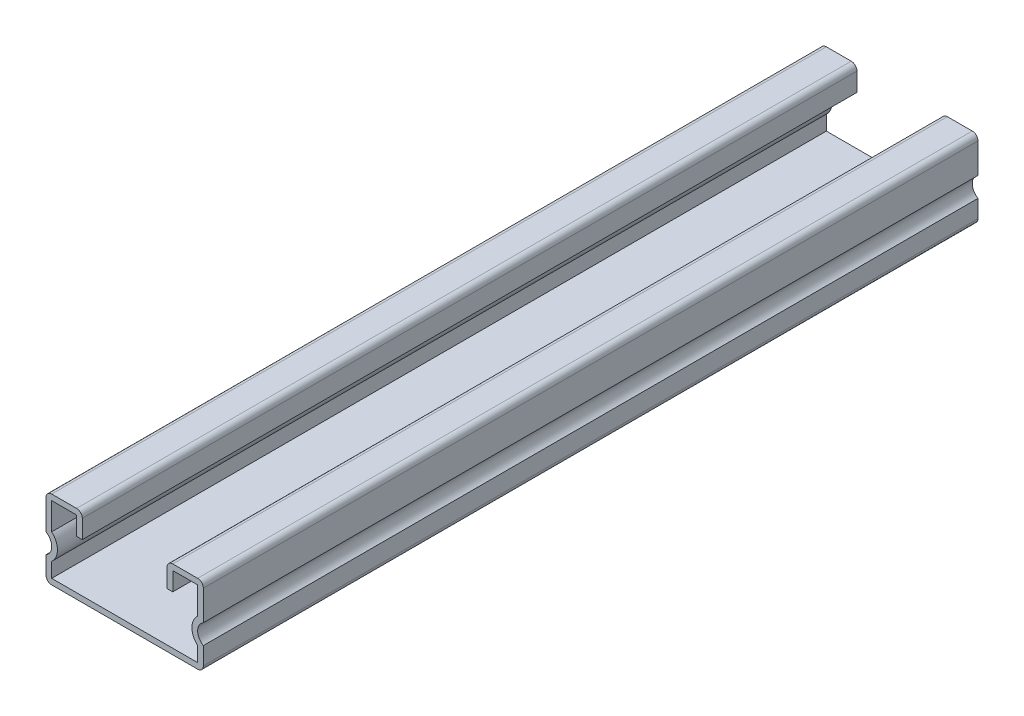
ISO-10303-21;
HEADER;
FILE_DESCRIPTION(('STEP AP214'),'2;1');
FILE_NAME('part.step','',(''),(''),'','','');
FILE_SCHEMA(('AUTOMOTIVE_DESIGN { 1 0 10303 214 1 1 1 1 }'));
ENDSEC;
DATA;
#1=APPLICATION_CONTEXT('core data for automotive mechanical design processes');
#2=APPLICATION_PROTOCOL_DEFINITION('international standard','automotive_design',2000,#1);
#3=PRODUCT_CONTEXT('',#1,'mechanical');
#4=PRODUCT('Part','Part','',(#3));
#5=PRODUCT_RELATED_PRODUCT_CATEGORY('part','',(#4));
#6=PRODUCT_DEFINITION_FORMATION('','',#4);
#7=PRODUCT_DEFINITION_CONTEXT('part definition',#1,'design');
#8=PRODUCT_DEFINITION('design','',#6,#7);
#9=PRODUCT_DEFINITION_SHAPE('','',#8);
#10=(LENGTH_UNIT() NAMED_UNIT(*) SI_UNIT(.MILLI.,.METRE.));
#11=(NAMED_UNIT(*) PLANE_ANGLE_UNIT() SI_UNIT($,.RADIAN.));
#12=(NAMED_UNIT(*) SI_UNIT($,.STERADIAN.) SOLID_ANGLE_UNIT());
#13=UNCERTAINTY_MEASURE_WITH_UNIT(LENGTH_MEASURE(1.E-05),#10,'distance_accuracy_value','');
#14=(GEOMETRIC_REPRESENTATION_CONTEXT(3) GLOBAL_UNCERTAINTY_ASSIGNED_CONTEXT((#13)) GLOBAL_UNIT_ASSIGNED_CONTEXT((#10,
#11,#12)) REPRESENTATION_CONTEXT('',''));
#15=CARTESIAN_POINT('',(0.,0.,0.));
#16=DIRECTION('',(0.,0.,1.));
#17=DIRECTION('',(1.,0.,0.));
#18=AXIS2_PLACEMENT_3D('',#15,#16,#17);
#19=CARTESIAN_POINT('',(-19.1389,10.4394,203.2));
#20=DIRECTION('',(-1.,0.,0.));
#21=DIRECTION('',(0.,0.,1.));
#22=AXIS2_PLACEMENT_3D('',#19,#20,#21);
#23=PLANE('',#22);
#24=DIRECTION('',(0.,1.,0.));
#25=VECTOR('',#24,1.);
#26=CARTESIAN_POINT('',(-19.1389,10.4394,0.));
#27=LINE('',#26,#25);
#28=CARTESIAN_POINT('',(-19.1389,3.35097147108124,0.));
#29=VERTEX_POINT('',#28);
#30=CARTESIAN_POINT('',(-19.1389,10.4394,0.));
#31=VERTEX_POINT('',#30);
#32=EDGE_CURVE('E326',#29,#31,#27,.T.);
#33=ORIENTED_EDGE('',*,*,#32,.T.);
#34=DIRECTION('',(0.,0.,-1.));
#35=VECTOR('',#34,1.);
#36=CARTESIAN_POINT('',(-19.1389,10.4394,203.2));
#37=LINE('',#36,#35);
#38=CARTESIAN_POINT('',(-19.1389,10.4394,203.2));
#39=VERTEX_POINT('',#38);
#40=EDGE_CURVE('E541',#39,#31,#37,.T.);
#41=ORIENTED_EDGE('',*,*,#40,.F.);
#42=DIRECTION('',(0.,1.,0.));
#43=VECTOR('',#42,1.);
#44=CARTESIAN_POINT('',(-19.1389,10.4394,203.2));
#45=LINE('',#44,#43);
#46=CARTESIAN_POINT('',(-19.1389,3.35097147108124,203.2));
#47=VERTEX_POINT('',#46);
#48=EDGE_CURVE('E333',#47,#39,#45,.T.);
#49=ORIENTED_EDGE('',*,*,#48,.F.);
#50=DIRECTION('',(0.,0.,-1.));
#51=VECTOR('',#50,1.);
#52=CARTESIAN_POINT('',(-19.1389,3.35097147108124,203.2));
#53=LINE('',#52,#51);
#54=EDGE_CURVE('E395',#47,#29,#53,.T.);
#55=ORIENTED_EDGE('',*,*,#54,.T.);
#56=EDGE_LOOP('',(#33,#41,#49,#55));
#57=FACE_BOUND('',#56,.T.);
#58=ADVANCED_FACE('F33',(#57),#23,.F.);
#59=CARTESIAN_POINT('',(-19.1389,10.4394,203.2));
#60=DIRECTION('',(0.,1.,0.));
#61=DIRECTION('',(-1.,0.,0.));
#62=AXIS2_PLACEMENT_3D('',#59,#60,#61);
#63=PLANE('',#62);
#64=DIRECTION('',(1.,0.,0.));
#65=VECTOR('',#64,1.);
#66=CARTESIAN_POINT('',(-19.1389,10.4394,0.));
#67=LINE('',#66,#65);
#68=CARTESIAN_POINT('',(-12.6111,10.4394,0.));
#69=VERTEX_POINT('',#68);
#70=EDGE_CURVE('E398',#31,#69,#67,.T.);
#71=ORIENTED_EDGE('',*,*,#70,.T.);
#72=DIRECTION('',(0.,0.,-1.));
#73=VECTOR('',#72,1.);
#74=CARTESIAN_POINT('',(-12.6111,10.4394,203.2));
#75=LINE('',#74,#73);
#76=CARTESIAN_POINT('',(-12.6111,10.4394,203.2));
#77=VERTEX_POINT('',#76);
#78=EDGE_CURVE('E538',#77,#69,#75,.T.);
#79=ORIENTED_EDGE('',*,*,#78,.F.);
#80=DIRECTION('',(1.,0.,0.));
#81=VECTOR('',#80,1.);
#82=CARTESIAN_POINT('',(-19.1389,10.4394,203.2));
#83=LINE('',#82,#81);
#84=EDGE_CURVE('E336',#39,#77,#83,.T.);
#85=ORIENTED_EDGE('',*,*,#84,.F.);
#86=ORIENTED_EDGE('',*,*,#40,.T.);
#87=EDGE_LOOP('',(#71,#79,#85,#86));
#88=FACE_BOUND('',#87,.T.);
#89=ADVANCED_FACE('F582',(#88),#63,.F.);
#90=CARTESIAN_POINT('',(-12.6111,10.4394,203.2));
#91=DIRECTION('',(1.,0.,0.));
#92=DIRECTION('',(0.,0.,-1.));
#93=AXIS2_PLACEMENT_3D('',#90,#91,#92);
#94=PLANE('',#93);
#95=DIRECTION('',(0.,-1.,0.));
#96=VECTOR('',#95,1.);
#97=CARTESIAN_POINT('',(-12.6111,10.4394,0.));
#98=LINE('',#97,#96);
#99=CARTESIAN_POINT('',(-12.6111,5.588,0.));
#100=VERTEX_POINT('',#99);
#101=EDGE_CURVE('E400',#69,#100,#98,.T.);
#102=ORIENTED_EDGE('',*,*,#101,.T.);
#103=DIRECTION('',(0.,0.,-1.));
#104=VECTOR('',#103,1.);
#105=CARTESIAN_POINT('',(-12.6111,5.588,203.2));
#106=LINE('',#105,#104);
#107=CARTESIAN_POINT('',(-12.6111,5.588,203.2));
#108=VERTEX_POINT('',#107);
#109=EDGE_CURVE('E535',#108,#100,#106,.T.);
#110=ORIENTED_EDGE('',*,*,#109,.F.);
#111=DIRECTION('',(0.,-1.,0.));
#112=VECTOR('',#111,1.);
#113=CARTESIAN_POINT('',(-12.6111,10.4394,203.2));
#114=LINE('',#113,#112);
#115=EDGE_CURVE('E339',#77,#108,#114,.T.);
#116=ORIENTED_EDGE('',*,*,#115,.F.);
#117=ORIENTED_EDGE('',*,*,#78,.T.);
#118=EDGE_LOOP('',(#102,#110,#116,#117));
#119=FACE_BOUND('',#118,.T.);
#120=ADVANCED_FACE('F587',(#119),#94,.F.);
#121=CARTESIAN_POINT('',(-12.6111,5.588,203.2));
#122=DIRECTION('',(0.,1.,0.));
#123=DIRECTION('',(0.,0.,1.));
#124=AXIS2_PLACEMENT_3D('',#121,#122,#123);
#125=PLANE('',#124);
#126=DIRECTION('',(1.,0.,0.));
#127=VECTOR('',#126,1.);
#128=CARTESIAN_POINT('',(-12.6111,5.588,0.));
#129=LINE('',#128,#127);
#130=CARTESIAN_POINT('',(-11.1125,5.588,0.));
#131=VERTEX_POINT('',#130);
#132=EDGE_CURVE('E402',#100,#131,#129,.T.);
#133=ORIENTED_EDGE('',*,*,#132,.T.);
#134=DIRECTION('',(0.,0.,-1.));
#135=VECTOR('',#134,1.);
#136=CARTESIAN_POINT('',(-11.1125,5.588,203.2));
#137=LINE('',#136,#135);
#138=CARTESIAN_POINT('',(-11.1125,5.588,203.2));
#139=VERTEX_POINT('',#138);
#140=EDGE_CURVE('E532',#139,#131,#137,.T.);
#141=ORIENTED_EDGE('',*,*,#140,.F.);
#142=DIRECTION('',(1.,0.,0.));
#143=VECTOR('',#142,1.);
#144=CARTESIAN_POINT('',(-12.6111,5.588,203.2));
#145=LINE('',#144,#143);
#146=EDGE_CURVE('E341',#108,#139,#145,.T.);
#147=ORIENTED_EDGE('',*,*,#146,.F.);
#148=ORIENTED_EDGE('',*,*,#109,.T.);
#149=EDGE_LOOP('',(#133,#141,#147,#148));
#150=FACE_BOUND('',#149,.T.);
#151=ADVANCED_FACE('F728',(#150),#125,.F.);
#152=CARTESIAN_POINT('',(-11.1125,10.4394,203.2));
#153=DIRECTION('',(-1.,0.,0.));
#154=DIRECTION('',(0.,-1.,0.));
#155=AXIS2_PLACEMENT_3D('',#152,#153,#154);
#156=PLANE('',#155);
#157=DIRECTION('',(0.,1.,0.));
#158=VECTOR('',#157,1.);
#159=CARTESIAN_POINT('',(-11.1125,10.4394,0.));
#160=LINE('',#159,#158);
#161=CARTESIAN_POINT('',(-11.1125,10.4394,0.));
#162=VERTEX_POINT('',#161);
#163=EDGE_CURVE('E404',#131,#162,#160,.T.);
#164=ORIENTED_EDGE('',*,*,#163,.T.);
#165=DIRECTION('',(0.,0.,-1.));
#166=VECTOR('',#165,1.);
#167=CARTESIAN_POINT('',(-11.1125,10.4394,203.2));
#168=LINE('',#167,#166);
#169=CARTESIAN_POINT('',(-11.1125,10.4394,203.2));
#170=VERTEX_POINT('',#169);
#171=EDGE_CURVE('E529',#170,#162,#168,.T.);
#172=ORIENTED_EDGE('',*,*,#171,.F.);
#173=DIRECTION('',(0.,1.,0.));
#174=VECTOR('',#173,1.);
#175=CARTESIAN_POINT('',(-11.1125,10.4394,203.2));
#176=LINE('',#175,#174);
#177=EDGE_CURVE('E343',#139,#170,#176,.T.);
#178=ORIENTED_EDGE('',*,*,#177,.F.);
#179=ORIENTED_EDGE('',*,*,#140,.T.);
#180=EDGE_LOOP('',(#164,#172,#178,#179));
#181=FACE_BOUND('',#180,.T.);
#182=ADVANCED_FACE('F725',(#181),#156,.F.);
#183=CARTESIAN_POINT('',(-12.6111,10.4394,203.2));
#184=DIRECTION('',(0.,0.,-1.));
#185=DIRECTION('',(-1.,0.,0.));
#186=AXIS2_PLACEMENT_3D('',#183,#184,#185);
#187=CYLINDRICAL_SURFACE('',#186,1.4986);
#188=CARTESIAN_POINT('',(-12.6111,10.4394,0.));
#189=DIRECTION('',(0.,0.,1.));
#190=DIRECTION('',(-1.,0.,0.));
#191=AXIS2_PLACEMENT_3D('',#188,#189,#190);
#192=CIRCLE('',#191,1.4986);
#193=CARTESIAN_POINT('',(-12.6111,11.938,0.));
#194=VERTEX_POINT('',#193);
#195=EDGE_CURVE('E406',#162,#194,#192,.T.);
#196=ORIENTED_EDGE('',*,*,#195,.T.);
#197=DIRECTION('',(0.,0.,-1.));
#198=VECTOR('',#197,1.);
#199=CARTESIAN_POINT('',(-12.6111,11.938,203.2));
#200=LINE('',#199,#198);
#201=CARTESIAN_POINT('',(-12.6111,11.938,203.2));
#202=VERTEX_POINT('',#201);
#203=EDGE_CURVE('E526',#202,#194,#200,.T.);
#204=ORIENTED_EDGE('',*,*,#203,.F.);
#205=CARTESIAN_POINT('',(-12.6111,10.4394,203.2));
#206=DIRECTION('',(0.,0.,1.));
#207=DIRECTION('',(-1.,0.,0.));
#208=AXIS2_PLACEMENT_3D('',#205,#206,#207);
#209=CIRCLE('',#208,1.4986);
#210=EDGE_CURVE('E345',#170,#202,#209,.T.);
#211=ORIENTED_EDGE('',*,*,#210,.F.);
#212=ORIENTED_EDGE('',*,*,#171,.T.);
#213=EDGE_LOOP('',(#196,#204,#211,#212));
#214=FACE_BOUND('',#213,.T.);
#215=ADVANCED_FACE('F721',(#214),#187,.T.);
#216=CARTESIAN_POINT('',(-19.1389,11.938,203.2));
#217=DIRECTION('',(0.,-1.,0.));
#218=DIRECTION('',(0.,0.,-1.));
#219=AXIS2_PLACEMENT_3D('',#216,#217,#218);
#220=PLANE('',#219);
#221=DIRECTION('',(-1.,0.,0.));
#222=VECTOR('',#221,1.);
#223=CARTESIAN_POINT('',(-19.1389,11.938,0.));
#224=LINE('',#223,#222);
#225=CARTESIAN_POINT('',(-19.1389,11.938,0.));
#226=VERTEX_POINT('',#225);
#227=EDGE_CURVE('E408',#194,#226,#224,.T.);
#228=ORIENTED_EDGE('',*,*,#227,.T.);
#229=DIRECTION('',(0.,0.,-1.));
#230=VECTOR('',#229,1.);
#231=CARTESIAN_POINT('',(-19.1389,11.938,203.2));
#232=LINE('',#231,#230);
#233=CARTESIAN_POINT('',(-19.1389,11.938,203.2));
#234=VERTEX_POINT('',#233);
#235=EDGE_CURVE('E523',#234,#226,#232,.T.);
#236=ORIENTED_EDGE('',*,*,#235,.F.);
#237=DIRECTION('',(-1.,0.,0.));
#238=VECTOR('',#237,1.);
#239=CARTESIAN_POINT('',(-19.1389,11.938,203.2));
#240=LINE('',#239,#238);
#241=EDGE_CURVE('E347',#202,#234,#240,.T.);
#242=ORIENTED_EDGE('',*,*,#241,.F.);
#243=ORIENTED_EDGE('',*,*,#203,.T.);
#244=EDGE_LOOP('',(#228,#236,#242,#243));
#245=FACE_BOUND('',#244,.T.);
#246=ADVANCED_FACE('F716',(#245),#220,.F.);
#247=CARTESIAN_POINT('',(-19.1389,10.4394,203.2));
#248=DIRECTION('',(0.,0.,-1.));
#249=DIRECTION('',(-1.,0.,0.));
#250=AXIS2_PLACEMENT_3D('',#247,#248,#249);
#251=CYLINDRICAL_SURFACE('',#250,1.49860000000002);
#252=CARTESIAN_POINT('',(-19.1389,10.4394,0.));
#253=DIRECTION('',(0.,0.,1.));
#254=DIRECTION('',(-1.,0.,0.));
#255=AXIS2_PLACEMENT_3D('',#252,#253,#254);
#256=CIRCLE('',#255,1.49860000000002);
#257=CARTESIAN_POINT('',(-20.6375,10.4394,0.));
#258=VERTEX_POINT('',#257);
#259=EDGE_CURVE('E410',#226,#258,#256,.T.);
#260=ORIENTED_EDGE('',*,*,#259,.T.);
#261=DIRECTION('',(0.,0.,-1.));
#262=VECTOR('',#261,1.);
#263=CARTESIAN_POINT('',(-20.6375,10.4394,203.2));
#264=LINE('',#263,#262);
#265=CARTESIAN_POINT('',(-20.6375,10.4394,203.2));
#266=VERTEX_POINT('',#265);
#267=EDGE_CURVE('E520',#266,#258,#264,.T.);
#268=ORIENTED_EDGE('',*,*,#267,.F.);
#269=CARTESIAN_POINT('',(-19.1389,10.4394,203.2));
#270=DIRECTION('',(0.,0.,1.));
#271=DIRECTION('',(-1.,0.,0.));
#272=AXIS2_PLACEMENT_3D('',#269,#270,#271);
#273=CIRCLE('',#272,1.49860000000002);
#274=EDGE_CURVE('E349',#234,#266,#273,.T.);
#275=ORIENTED_EDGE('',*,*,#274,.F.);
#276=ORIENTED_EDGE('',*,*,#235,.T.);
#277=EDGE_LOOP('',(#260,#268,#275,#276));
#278=FACE_BOUND('',#277,.T.);
#279=ADVANCED_FACE('F710',(#278),#251,.T.);
#280=CARTESIAN_POINT('',(-20.6375,10.4394,203.2));
#281=DIRECTION('',(1.,0.,0.));
#282=DIRECTION('',(0.,1.,0.));
#283=AXIS2_PLACEMENT_3D('',#280,#281,#282);
#284=PLANE('',#283);
#285=DIRECTION('',(0.,-1.,0.));
#286=VECTOR('',#285,1.);
#287=CARTESIAN_POINT('',(-20.6375,10.4394,0.));
#288=LINE('',#287,#286);
#289=CARTESIAN_POINT('',(-20.6375,2.59565134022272,0.));
#290=VERTEX_POINT('',#289);
#291=EDGE_CURVE('E412',#258,#290,#288,.T.);
#292=ORIENTED_EDGE('',*,*,#291,.T.);
#293=DIRECTION('',(0.,0.,-1.));
#294=VECTOR('',#293,1.);
#295=CARTESIAN_POINT('',(-20.6375,2.59565134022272,203.2));
#296=LINE('',#295,#294);
#297=CARTESIAN_POINT('',(-20.6375,2.59565134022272,203.2));
#298=VERTEX_POINT('',#297);
#299=EDGE_CURVE('E517',#298,#290,#296,.T.);
#300=ORIENTED_EDGE('',*,*,#299,.F.);
#301=DIRECTION('',(0.,-1.,0.));
#302=VECTOR('',#301,1.);
#303=CARTESIAN_POINT('',(-20.6375,10.4394,203.2));
#304=LINE('',#303,#302);
#305=EDGE_CURVE('E351',#266,#298,#304,.T.);
#306=ORIENTED_EDGE('',*,*,#305,.F.);
#307=ORIENTED_EDGE('',*,*,#267,.T.);
#308=EDGE_LOOP('',(#292,#300,#306,#307));
#309=FACE_BOUND('',#308,.T.);
#310=ADVANCED_FACE('F706',(#309),#284,.F.);
#311=CARTESIAN_POINT('',(-22.1361,0.,203.2));
#312=DIRECTION('',(0.,0.,-1.));
#313=DIRECTION('',(-1.,0.,0.));
#314=AXIS2_PLACEMENT_3D('',#311,#312,#313);
#315=CYLINDRICAL_SURFACE('',#314,2.9972);
#316=CARTESIAN_POINT('',(-22.1361,0.,0.));
#317=DIRECTION('',(0.,0.,-1.));
#318=DIRECTION('',(1.,0.,0.));
#319=AXIS2_PLACEMENT_3D('',#316,#317,#318);
#320=CIRCLE('',#319,2.9972);
#321=CARTESIAN_POINT('',(-20.6375,-2.59565134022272,0.));
#322=VERTEX_POINT('',#321);
#323=EDGE_CURVE('E414',#290,#322,#320,.T.);
#324=ORIENTED_EDGE('',*,*,#323,.T.);
#325=DIRECTION('',(0.,0.,-1.));
#326=VECTOR('',#325,1.);
#327=CARTESIAN_POINT('',(-20.6375,-2.59565134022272,203.2));
#328=LINE('',#327,#326);
#329=CARTESIAN_POINT('',(-20.6375,-2.59565134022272,203.2));
#330=VERTEX_POINT('',#329);
#331=EDGE_CURVE('E514',#330,#322,#328,.T.);
#332=ORIENTED_EDGE('',*,*,#331,.F.);
#333=CARTESIAN_POINT('',(-22.1361,0.,203.2));
#334=DIRECTION('',(0.,0.,-1.));
#335=DIRECTION('',(1.,0.,0.));
#336=AXIS2_PLACEMENT_3D('',#333,#334,#335);
#337=CIRCLE('',#336,2.9972);
#338=EDGE_CURVE('E353',#298,#330,#337,.T.);
#339=ORIENTED_EDGE('',*,*,#338,.F.);
#340=ORIENTED_EDGE('',*,*,#299,.T.);
#341=EDGE_LOOP('',(#324,#332,#339,#340));
#342=FACE_BOUND('',#341,.T.);
#343=ADVANCED_FACE('F701',(#342),#315,.F.);
#344=CARTESIAN_POINT('',(-20.6375,-2.59565134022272,203.2));
#345=DIRECTION('',(1.,0.,0.));
#346=DIRECTION('',(0.,1.,0.));
#347=AXIS2_PLACEMENT_3D('',#344,#345,#346);
#348=PLANE('',#347);
#349=DIRECTION('',(0.,-1.,0.));
#350=VECTOR('',#349,1.);
#351=CARTESIAN_POINT('',(-20.6375,-2.59565134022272,0.));
#352=LINE('',#351,#350);
#353=CARTESIAN_POINT('',(-20.6375,-7.2136,0.));
#354=VERTEX_POINT('',#353);
#355=EDGE_CURVE('E416',#322,#354,#352,.T.);
#356=ORIENTED_EDGE('',*,*,#355,.T.);
#357=DIRECTION('',(0.,0.,-1.));
#358=VECTOR('',#357,1.);
#359=CARTESIAN_POINT('',(-20.6375,-7.2136,203.2));
#360=LINE('',#359,#358);
#361=CARTESIAN_POINT('',(-20.6375,-7.2136,203.2));
#362=VERTEX_POINT('',#361);
#363=EDGE_CURVE('E511',#362,#354,#360,.T.);
#364=ORIENTED_EDGE('',*,*,#363,.F.);
#365=DIRECTION('',(0.,-1.,0.));
#366=VECTOR('',#365,1.);
#367=CARTESIAN_POINT('',(-20.6375,-2.59565134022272,203.2));
#368=LINE('',#367,#366);
#369=EDGE_CURVE('E355',#330,#362,#368,.T.);
#370=ORIENTED_EDGE('',*,*,#369,.F.);
#371=ORIENTED_EDGE('',*,*,#331,.T.);
#372=EDGE_LOOP('',(#356,#364,#370,#371));
#373=FACE_BOUND('',#372,.T.);
#374=ADVANCED_FACE('F695',(#373),#348,.F.);
#375=CARTESIAN_POINT('',(-19.1389,-7.2136,203.2));
#376=DIRECTION('',(0.,0.,-1.));
#377=DIRECTION('',(-1.,0.,0.));
#378=AXIS2_PLACEMENT_3D('',#375,#376,#377);
#379=CYLINDRICAL_SURFACE('',#378,1.4986);
#380=CARTESIAN_POINT('',(-19.1389,-7.2136,0.));
#381=DIRECTION('',(0.,0.,1.));
#382=DIRECTION('',(-1.,0.,0.));
#383=AXIS2_PLACEMENT_3D('',#380,#381,#382);
#384=CIRCLE('',#383,1.4986);
#385=CARTESIAN_POINT('',(-19.1389,-8.7122,0.));
#386=VERTEX_POINT('',#385);
#387=EDGE_CURVE('E418',#354,#386,#384,.T.);
#388=ORIENTED_EDGE('',*,*,#387,.T.);
#389=DIRECTION('',(0.,0.,-1.));
#390=VECTOR('',#389,1.);
#391=CARTESIAN_POINT('',(-19.1389,-8.7122,203.2));
#392=LINE('',#391,#390);
#393=CARTESIAN_POINT('',(-19.1389,-8.7122,203.2));
#394=VERTEX_POINT('',#393);
#395=EDGE_CURVE('E508',#394,#386,#392,.T.);
#396=ORIENTED_EDGE('',*,*,#395,.F.);
#397=CARTESIAN_POINT('',(-19.1389,-7.2136,203.2));
#398=DIRECTION('',(0.,0.,1.));
#399=DIRECTION('',(-1.,0.,0.));
#400=AXIS2_PLACEMENT_3D('',#397,#398,#399);
#401=CIRCLE('',#400,1.4986);
#402=EDGE_CURVE('E357',#362,#394,#401,.T.);
#403=ORIENTED_EDGE('',*,*,#402,.F.);
#404=ORIENTED_EDGE('',*,*,#363,.T.);
#405=EDGE_LOOP('',(#388,#396,#403,#404));
#406=FACE_BOUND('',#405,.T.);
#407=ADVANCED_FACE('F691',(#406),#379,.T.);
#408=CARTESIAN_POINT('',(-19.1389,-8.7122,203.2));
#409=DIRECTION('',(0.,1.,0.));
#410=DIRECTION('',(0.,0.,1.));
#411=AXIS2_PLACEMENT_3D('',#408,#409,#410);
#412=PLANE('',#411);
#413=DIRECTION('',(0.,0.,-1.));
#414=VECTOR('',#413,1.);
#415=CARTESIAN_POINT('',(-5.159375,-8.71219999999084,114.3));
#416=LINE('',#415,#414);
#417=CARTESIAN_POINT('',(-5.15937500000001,-8.7122,180.18125));
#418=VERTEX_POINT('',#417);
#419=CARTESIAN_POINT('',(-5.159375,-8.71219999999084,114.3));
#420=VERTEX_POINT('',#419);
#421=EDGE_CURVE('E279',#418,#420,#416,.T.);
#422=ORIENTED_EDGE('',*,*,#421,.F.);
#423=CARTESIAN_POINT('',(0.,-8.71219999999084,180.18125));
#424=DIRECTION('',(0.,-1.,0.));
#425=DIRECTION('',(0.,0.,-1.));
#426=AXIS2_PLACEMENT_3D('',#423,#424,#425);
#427=CIRCLE('',#426,5.159375);
#428=CARTESIAN_POINT('',(5.159375,-8.71219999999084,180.18125));
#429=VERTEX_POINT('',#428);
#430=EDGE_CURVE('E47',#429,#418,#427,.T.);
#431=ORIENTED_EDGE('',*,*,#430,.F.);
#432=DIRECTION('',(0.,0.,1.));
#433=VECTOR('',#432,1.);
#434=CARTESIAN_POINT('',(5.159375,-8.71219999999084,180.18125));
#435=LINE('',#434,#433);
#436=CARTESIAN_POINT('',(5.159375,-8.71219999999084,114.3));
#437=VERTEX_POINT('',#436);
#438=EDGE_CURVE('E295',#437,#429,#435,.T.);
#439=ORIENTED_EDGE('',*,*,#438,.F.);
#440=CARTESIAN_POINT('',(0.,-8.71219999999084,114.3));
#441=DIRECTION('',(0.,-1.,0.));
#442=DIRECTION('',(0.,0.,-1.));
#443=AXIS2_PLACEMENT_3D('',#440,#441,#442);
#444=CIRCLE('',#443,5.159375);
#445=EDGE_CURVE('E289',#420,#437,#444,.T.);
#446=ORIENTED_EDGE('',*,*,#445,.F.);
#447=EDGE_LOOP('',(#422,#431,#439,#446));
#448=FACE_BOUND('',#447,.T.);
#449=DIRECTION('',(0.,0.,-1.));
#450=VECTOR('',#449,1.);
#451=CARTESIAN_POINT('',(-5.159375,-8.71219999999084,12.7));
#452=LINE('',#451,#450);
#453=CARTESIAN_POINT('',(-5.15937500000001,-8.7122,78.58125));
#454=VERTEX_POINT('',#453);
#455=CARTESIAN_POINT('',(-5.159375,-8.71219999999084,12.7));
#456=VERTEX_POINT('',#455);
#457=EDGE_CURVE('E314',#454,#456,#452,.T.);
#458=ORIENTED_EDGE('',*,*,#457,.F.);
#459=CARTESIAN_POINT('',(0.,-8.71219999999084,78.58125));
#460=DIRECTION('',(0.,-1.,0.));
#461=DIRECTION('',(0.,0.,-1.));
#462=AXIS2_PLACEMENT_3D('',#459,#460,#461);
#463=CIRCLE('',#462,5.159375);
#464=CARTESIAN_POINT('',(5.159375,-8.71219999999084,78.58125));
#465=VERTEX_POINT('',#464);
#466=EDGE_CURVE('E312',#465,#454,#463,.T.);
#467=ORIENTED_EDGE('',*,*,#466,.F.);
#468=DIRECTION('',(0.,0.,1.));
#469=VECTOR('',#468,1.);
#470=CARTESIAN_POINT('',(5.159375,-8.71219999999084,78.58125));
#471=LINE('',#470,#469);
#472=CARTESIAN_POINT('',(5.159375,-8.71219999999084,12.7));
#473=VERTEX_POINT('',#472);
#474=EDGE_CURVE('E320',#473,#465,#471,.T.);
#475=ORIENTED_EDGE('',*,*,#474,.F.);
#476=CARTESIAN_POINT('',(0.,-8.71219999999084,12.7));
#477=DIRECTION('',(0.,-1.,0.));
#478=DIRECTION('',(0.,0.,-1.));
#479=AXIS2_PLACEMENT_3D('',#476,#477,#478);
#480=CIRCLE('',#479,5.159375);
#481=EDGE_CURVE('E317',#456,#473,#480,.T.);
#482=ORIENTED_EDGE('',*,*,#481,.F.);
#483=EDGE_LOOP('',(#458,#467,#475,#482));
#484=FACE_BOUND('',#483,.T.);
#485=DIRECTION('',(1.,0.,0.));
#486=VECTOR('',#485,1.);
#487=CARTESIAN_POINT('',(-19.1389,-8.7122,0.));
#488=LINE('',#487,#486);
#489=CARTESIAN_POINT('',(19.1389,-8.7122,0.));
#490=VERTEX_POINT('',#489);
#491=EDGE_CURVE('E420',#386,#490,#488,.T.);
#492=ORIENTED_EDGE('',*,*,#491,.T.);
#493=DIRECTION('',(0.,0.,-1.));
#494=VECTOR('',#493,1.);
#495=CARTESIAN_POINT('',(19.1389,-8.7122,203.2));
#496=LINE('',#495,#494);
#497=CARTESIAN_POINT('',(19.1389,-8.7122,203.2));
#498=VERTEX_POINT('',#497);
#499=EDGE_CURVE('E505',#498,#490,#496,.T.);
#500=ORIENTED_EDGE('',*,*,#499,.F.);
#501=DIRECTION('',(1.,0.,0.));
#502=VECTOR('',#501,1.);
#503=CARTESIAN_POINT('',(-19.1389,-8.7122,203.2));
#504=LINE('',#503,#502);
#505=EDGE_CURVE('E359',#394,#498,#504,.T.);
#506=ORIENTED_EDGE('',*,*,#505,.F.);
#507=ORIENTED_EDGE('',*,*,#395,.T.);
#508=EDGE_LOOP('',(#492,#500,#506,#507));
#509=FACE_BOUND('',#508,.T.);
#510=ADVANCED_FACE('F293',(#448,#484,#509),#412,.F.);
#511=CARTESIAN_POINT('',(19.1389,-7.2136,203.2));
#512=DIRECTION('',(0.,0.,-1.));
#513=DIRECTION('',(-1.,0.,0.));
#514=AXIS2_PLACEMENT_3D('',#511,#512,#513);
#515=CYLINDRICAL_SURFACE('',#514,1.4986);
#516=CARTESIAN_POINT('',(19.1389,-7.2136,0.));
#517=DIRECTION('',(0.,0.,1.));
#518=DIRECTION('',(-1.,0.,0.));
#519=AXIS2_PLACEMENT_3D('',#516,#517,#518);
#520=CIRCLE('',#519,1.4986);
#521=CARTESIAN_POINT('',(20.6375,-7.2136,0.));
#522=VERTEX_POINT('',#521);
#523=EDGE_CURVE('E422',#490,#522,#520,.T.);
#524=ORIENTED_EDGE('',*,*,#523,.T.);
#525=DIRECTION('',(0.,0.,-1.));
#526=VECTOR('',#525,1.);
#527=CARTESIAN_POINT('',(20.6375,-7.2136,203.2));
#528=LINE('',#527,#526);
#529=CARTESIAN_POINT('',(20.6375,-7.2136,203.2));
#530=VERTEX_POINT('',#529);
#531=EDGE_CURVE('E502',#530,#522,#528,.T.);
#532=ORIENTED_EDGE('',*,*,#531,.F.);
#533=CARTESIAN_POINT('',(19.1389,-7.2136,203.2));
#534=DIRECTION('',(0.,0.,1.));
#535=DIRECTION('',(-1.,0.,0.));
#536=AXIS2_PLACEMENT_3D('',#533,#534,#535);
#537=CIRCLE('',#536,1.4986);
#538=EDGE_CURVE('E361',#498,#530,#537,.T.);
#539=ORIENTED_EDGE('',*,*,#538,.F.);
#540=ORIENTED_EDGE('',*,*,#499,.T.);
#541=EDGE_LOOP('',(#524,#532,#539,#540));
#542=FACE_BOUND('',#541,.T.);
#543=ADVANCED_FACE('F682',(#542),#515,.T.);
#544=CARTESIAN_POINT('',(20.6375,-7.2136,203.2));
#545=DIRECTION('',(-1.,0.,0.));
#546=DIRECTION('',(0.,0.,1.));
#547=AXIS2_PLACEMENT_3D('',#544,#545,#546);
#548=PLANE('',#547);
#549=DIRECTION('',(0.,1.,0.));
#550=VECTOR('',#549,1.);
#551=CARTESIAN_POINT('',(20.6375,-7.2136,0.));
#552=LINE('',#551,#550);
#553=CARTESIAN_POINT('',(20.6375,-2.59565134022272,0.));
#554=VERTEX_POINT('',#553);
#555=EDGE_CURVE('E424',#522,#554,#552,.T.);
#556=ORIENTED_EDGE('',*,*,#555,.T.);
#557=DIRECTION('',(0.,0.,-1.));
#558=VECTOR('',#557,1.);
#559=CARTESIAN_POINT('',(20.6375,-2.59565134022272,203.2));
#560=LINE('',#559,#558);
#561=CARTESIAN_POINT('',(20.6375,-2.59565134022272,203.2));
#562=VERTEX_POINT('',#561);
#563=EDGE_CURVE('E499',#562,#554,#560,.T.);
#564=ORIENTED_EDGE('',*,*,#563,.F.);
#565=DIRECTION('',(0.,1.,0.));
#566=VECTOR('',#565,1.);
#567=CARTESIAN_POINT('',(20.6375,-7.2136,203.2));
#568=LINE('',#567,#566);
#569=EDGE_CURVE('E363',#530,#562,#568,.T.);
#570=ORIENTED_EDGE('',*,*,#569,.F.);
#571=ORIENTED_EDGE('',*,*,#531,.T.);
#572=EDGE_LOOP('',(#556,#564,#570,#571));
#573=FACE_BOUND('',#572,.T.);
#574=ADVANCED_FACE('F678',(#573),#548,.F.);
#575=CARTESIAN_POINT('',(22.1361,0.,203.2));
#576=DIRECTION('',(0.,0.,-1.));
#577=DIRECTION('',(-1.,0.,0.));
#578=AXIS2_PLACEMENT_3D('',#575,#576,#577);
#579=CYLINDRICAL_SURFACE('',#578,2.9972);
#580=CARTESIAN_POINT('',(22.1361,0.,0.));
#581=DIRECTION('',(0.,0.,-1.));
#582=DIRECTION('',(1.,0.,0.));
#583=AXIS2_PLACEMENT_3D('',#580,#581,#582);
#584=CIRCLE('',#583,2.9972);
#585=CARTESIAN_POINT('',(20.6375,2.59565134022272,0.));
#586=VERTEX_POINT('',#585);
#587=EDGE_CURVE('E426',#554,#586,#584,.T.);
#588=ORIENTED_EDGE('',*,*,#587,.T.);
#589=DIRECTION('',(0.,0.,-1.));
#590=VECTOR('',#589,1.);
#591=CARTESIAN_POINT('',(20.6375,2.59565134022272,203.2));
#592=LINE('',#591,#590);
#593=CARTESIAN_POINT('',(20.6375,2.59565134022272,203.2));
#594=VERTEX_POINT('',#593);
#595=EDGE_CURVE('E496',#594,#586,#592,.T.);
#596=ORIENTED_EDGE('',*,*,#595,.F.);
#597=CARTESIAN_POINT('',(22.1361,0.,203.2));
#598=DIRECTION('',(0.,0.,-1.));
#599=DIRECTION('',(1.,0.,0.));
#600=AXIS2_PLACEMENT_3D('',#597,#598,#599);
#601=CIRCLE('',#600,2.9972);
#602=EDGE_CURVE('E365',#562,#594,#601,.T.);
#603=ORIENTED_EDGE('',*,*,#602,.F.);
#604=ORIENTED_EDGE('',*,*,#563,.T.);
#605=EDGE_LOOP('',(#588,#596,#603,#604));
#606=FACE_BOUND('',#605,.T.);
#607=ADVANCED_FACE('F673',(#606),#579,.F.);
#608=CARTESIAN_POINT('',(20.6375,2.59565134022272,203.2));
#609=DIRECTION('',(-1.,0.,0.));
#610=DIRECTION('',(0.,-1.,0.));
#611=AXIS2_PLACEMENT_3D('',#608,#609,#610);
#612=PLANE('',#611);
#613=DIRECTION('',(0.,1.,0.));
#614=VECTOR('',#613,1.);
#615=CARTESIAN_POINT('',(20.6375,2.59565134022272,0.));
#616=LINE('',#615,#614);
#617=CARTESIAN_POINT('',(20.6375,10.4394,0.));
#618=VERTEX_POINT('',#617);
#619=EDGE_CURVE('E428',#586,#618,#616,.T.);
#620=ORIENTED_EDGE('',*,*,#619,.T.);
#621=DIRECTION('',(0.,0.,-1.));
#622=VECTOR('',#621,1.);
#623=CARTESIAN_POINT('',(20.6375,10.4394,203.2));
#624=LINE('',#623,#622);
#625=CARTESIAN_POINT('',(20.6375,10.4394,203.2));
#626=VERTEX_POINT('',#625);
#627=EDGE_CURVE('E493',#626,#618,#624,.T.);
#628=ORIENTED_EDGE('',*,*,#627,.F.);
#629=DIRECTION('',(0.,1.,0.));
#630=VECTOR('',#629,1.);
#631=CARTESIAN_POINT('',(20.6375,2.59565134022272,203.2));
#632=LINE('',#631,#630);
#633=EDGE_CURVE('E367',#594,#626,#632,.T.);
#634=ORIENTED_EDGE('',*,*,#633,.F.);
#635=ORIENTED_EDGE('',*,*,#595,.T.);
#636=EDGE_LOOP('',(#620,#628,#634,#635));
#637=FACE_BOUND('',#636,.T.);
#638=ADVANCED_FACE('F667',(#637),#612,.F.);
#639=CARTESIAN_POINT('',(19.1389,10.4394,203.2));
#640=DIRECTION('',(0.,0.,-1.));
#641=DIRECTION('',(-1.,0.,0.));
#642=AXIS2_PLACEMENT_3D('',#639,#640,#641);
#643=CYLINDRICAL_SURFACE('',#642,1.4986);
#644=CARTESIAN_POINT('',(19.1389,10.4394,0.));
#645=DIRECTION('',(0.,0.,1.));
#646=DIRECTION('',(-1.,0.,0.));
#647=AXIS2_PLACEMENT_3D('',#644,#645,#646);
#648=CIRCLE('',#647,1.4986);
#649=CARTESIAN_POINT('',(19.1389,11.938,0.));
#650=VERTEX_POINT('',#649);
#651=EDGE_CURVE('E430',#618,#650,#648,.T.);
#652=ORIENTED_EDGE('',*,*,#651,.T.);
#653=DIRECTION('',(0.,0.,-1.));
#654=VECTOR('',#653,1.);
#655=CARTESIAN_POINT('',(19.1389,11.938,203.2));
#656=LINE('',#655,#654);
#657=CARTESIAN_POINT('',(19.1389,11.938,203.2));
#658=VERTEX_POINT('',#657);
#659=EDGE_CURVE('E490',#658,#650,#656,.T.);
#660=ORIENTED_EDGE('',*,*,#659,.F.);
#661=CARTESIAN_POINT('',(19.1389,10.4394,203.2));
#662=DIRECTION('',(0.,0.,1.));
#663=DIRECTION('',(-1.,0.,0.));
#664=AXIS2_PLACEMENT_3D('',#661,#662,#663);
#665=CIRCLE('',#664,1.4986);
#666=EDGE_CURVE('E369',#626,#658,#665,.T.);
#667=ORIENTED_EDGE('',*,*,#666,.F.);
#668=ORIENTED_EDGE('',*,*,#627,.T.);
#669=EDGE_LOOP('',(#652,#660,#667,#668));
#670=FACE_BOUND('',#669,.T.);
#671=ADVANCED_FACE('F663',(#670),#643,.T.);
#672=CARTESIAN_POINT('',(19.1389,11.938,203.2));
#673=DIRECTION('',(0.,-1.,0.));
#674=DIRECTION('',(1.,0.,0.));
#675=AXIS2_PLACEMENT_3D('',#672,#673,#674);
#676=PLANE('',#675);
#677=DIRECTION('',(-1.,0.,0.));
#678=VECTOR('',#677,1.);
#679=CARTESIAN_POINT('',(19.1389,11.938,0.));
#680=LINE('',#679,#678);
#681=CARTESIAN_POINT('',(12.6111,11.938,0.));
#682=VERTEX_POINT('',#681);
#683=EDGE_CURVE('E432',#650,#682,#680,.T.);
#684=ORIENTED_EDGE('',*,*,#683,.T.);
#685=DIRECTION('',(0.,0.,-1.));
#686=VECTOR('',#685,1.);
#687=CARTESIAN_POINT('',(12.6111,11.938,203.2));
#688=LINE('',#687,#686);
#689=CARTESIAN_POINT('',(12.6111,11.938,203.2));
#690=VERTEX_POINT('',#689);
#691=EDGE_CURVE('E487',#690,#682,#688,.T.);
#692=ORIENTED_EDGE('',*,*,#691,.F.);
#693=DIRECTION('',(-1.,0.,0.));
#694=VECTOR('',#693,1.);
#695=CARTESIAN_POINT('',(19.1389,11.938,203.2));
#696=LINE('',#695,#694);
#697=EDGE_CURVE('E371',#658,#690,#696,.T.);
#698=ORIENTED_EDGE('',*,*,#697,.F.);
#699=ORIENTED_EDGE('',*,*,#659,.T.);
#700=EDGE_LOOP('',(#684,#692,#698,#699));
#701=FACE_BOUND('',#700,.T.);
#702=ADVANCED_FACE('F658',(#701),#676,.F.);
#703=CARTESIAN_POINT('',(12.6111,10.4394,203.2));
#704=DIRECTION('',(0.,0.,-1.));
#705=DIRECTION('',(-1.,0.,0.));
#706=AXIS2_PLACEMENT_3D('',#703,#704,#705);
#707=CYLINDRICAL_SURFACE('',#706,1.4986);
#708=CARTESIAN_POINT('',(12.6111,10.4394,0.));
#709=DIRECTION('',(0.,0.,1.));
#710=DIRECTION('',(-1.,0.,0.));
#711=AXIS2_PLACEMENT_3D('',#708,#709,#710);
#712=CIRCLE('',#711,1.4986);
#713=CARTESIAN_POINT('',(11.1125,10.4394,0.));
#714=VERTEX_POINT('',#713);
#715=EDGE_CURVE('E434',#682,#714,#712,.T.);
#716=ORIENTED_EDGE('',*,*,#715,.T.);
#717=DIRECTION('',(0.,0.,-1.));
#718=VECTOR('',#717,1.);
#719=CARTESIAN_POINT('',(11.1125,10.4394,203.2));
#720=LINE('',#719,#718);
#721=CARTESIAN_POINT('',(11.1125,10.4394,203.2));
#722=VERTEX_POINT('',#721);
#723=EDGE_CURVE('E484',#722,#714,#720,.T.);
#724=ORIENTED_EDGE('',*,*,#723,.F.);
#725=CARTESIAN_POINT('',(12.6111,10.4394,203.2));
#726=DIRECTION('',(0.,0.,1.));
#727=DIRECTION('',(-1.,0.,0.));
#728=AXIS2_PLACEMENT_3D('',#725,#726,#727);
#729=CIRCLE('',#728,1.4986);
#730=EDGE_CURVE('E373',#690,#722,#729,.T.);
#731=ORIENTED_EDGE('',*,*,#730,.F.);
#732=ORIENTED_EDGE('',*,*,#691,.T.);
#733=EDGE_LOOP('',(#716,#724,#731,#732));
#734=FACE_BOUND('',#733,.T.);
#735=ADVANCED_FACE('F652',(#734),#707,.T.);
#736=CARTESIAN_POINT('',(11.1125,10.4394,203.2));
#737=DIRECTION('',(1.,0.,0.));
#738=DIRECTION('',(0.,0.,-1.));
#739=AXIS2_PLACEMENT_3D('',#736,#737,#738);
#740=PLANE('',#739);
#741=DIRECTION('',(0.,-1.,0.));
#742=VECTOR('',#741,1.);
#743=CARTESIAN_POINT('',(11.1125,10.4394,0.));
#744=LINE('',#743,#742);
#745=CARTESIAN_POINT('',(11.1125,5.588,0.));
#746=VERTEX_POINT('',#745);
#747=EDGE_CURVE('E436',#714,#746,#744,.T.);
#748=ORIENTED_EDGE('',*,*,#747,.T.);
#749=DIRECTION('',(0.,0.,-1.));
#750=VECTOR('',#749,1.);
#751=CARTESIAN_POINT('',(11.1125,5.588,203.2));
#752=LINE('',#751,#750);
#753=CARTESIAN_POINT('',(11.1125,5.588,203.2));
#754=VERTEX_POINT('',#753);
#755=EDGE_CURVE('E481',#754,#746,#752,.T.);
#756=ORIENTED_EDGE('',*,*,#755,.F.);
#757=DIRECTION('',(0.,-1.,0.));
#758=VECTOR('',#757,1.);
#759=CARTESIAN_POINT('',(11.1125,10.4394,203.2));
#760=LINE('',#759,#758);
#761=EDGE_CURVE('E375',#722,#754,#760,.T.);
#762=ORIENTED_EDGE('',*,*,#761,.F.);
#763=ORIENTED_EDGE('',*,*,#723,.T.);
#764=EDGE_LOOP('',(#748,#756,#762,#763));
#765=FACE_BOUND('',#764,.T.);
#766=ADVANCED_FACE('F648',(#765),#740,.F.);
#767=CARTESIAN_POINT('',(11.1125,5.588,203.2));
#768=DIRECTION('',(0.,1.,0.));
#769=DIRECTION('',(-1.,0.,0.));
#770=AXIS2_PLACEMENT_3D('',#767,#768,#769);
#771=PLANE('',#770);
#772=DIRECTION('',(1.,0.,0.));
#773=VECTOR('',#772,1.);
#774=CARTESIAN_POINT('',(11.1125,5.588,0.));
#775=LINE('',#774,#773);
#776=CARTESIAN_POINT('',(12.6111,5.588,0.));
#777=VERTEX_POINT('',#776);
#778=EDGE_CURVE('E438',#746,#777,#775,.T.);
#779=ORIENTED_EDGE('',*,*,#778,.T.);
#780=DIRECTION('',(0.,0.,-1.));
#781=VECTOR('',#780,1.);
#782=CARTESIAN_POINT('',(12.6111,5.588,203.2));
#783=LINE('',#782,#781);
#784=CARTESIAN_POINT('',(12.6111,5.588,203.2));
#785=VERTEX_POINT('',#784);
#786=EDGE_CURVE('E478',#785,#777,#783,.T.);
#787=ORIENTED_EDGE('',*,*,#786,.F.);
#788=DIRECTION('',(1.,0.,0.));
#789=VECTOR('',#788,1.);
#790=CARTESIAN_POINT('',(11.1125,5.588,203.2));
#791=LINE('',#790,#789);
#792=EDGE_CURVE('E377',#754,#785,#791,.T.);
#793=ORIENTED_EDGE('',*,*,#792,.F.);
#794=ORIENTED_EDGE('',*,*,#755,.T.);
#795=EDGE_LOOP('',(#779,#787,#793,#794));
#796=FACE_BOUND('',#795,.T.);
#797=ADVANCED_FACE('F643',(#796),#771,.F.);
#798=CARTESIAN_POINT('',(12.6111,10.4394,203.2));
#799=DIRECTION('',(-1.,0.,0.));
#800=DIRECTION('',(0.,0.,1.));
#801=AXIS2_PLACEMENT_3D('',#798,#799,#800);
#802=PLANE('',#801);
#803=DIRECTION('',(0.,1.,0.));
#804=VECTOR('',#803,1.);
#805=CARTESIAN_POINT('',(12.6111,10.4394,0.));
#806=LINE('',#805,#804);
#807=CARTESIAN_POINT('',(12.6111,10.4394,0.));
#808=VERTEX_POINT('',#807);
#809=EDGE_CURVE('E440',#777,#808,#806,.T.);
#810=ORIENTED_EDGE('',*,*,#809,.T.);
#811=DIRECTION('',(0.,0.,-1.));
#812=VECTOR('',#811,1.);
#813=CARTESIAN_POINT('',(12.6111,10.4394,203.2));
#814=LINE('',#813,#812);
#815=CARTESIAN_POINT('',(12.6111,10.4394,203.2));
#816=VERTEX_POINT('',#815);
#817=EDGE_CURVE('E475',#816,#808,#814,.T.);
#818=ORIENTED_EDGE('',*,*,#817,.F.);
#819=DIRECTION('',(0.,1.,0.));
#820=VECTOR('',#819,1.);
#821=CARTESIAN_POINT('',(12.6111,10.4394,203.2));
#822=LINE('',#821,#820);
#823=EDGE_CURVE('E379',#785,#816,#822,.T.);
#824=ORIENTED_EDGE('',*,*,#823,.F.);
#825=ORIENTED_EDGE('',*,*,#786,.T.);
#826=EDGE_LOOP('',(#810,#818,#824,#825));
#827=FACE_BOUND('',#826,.T.);
#828=ADVANCED_FACE('F637',(#827),#802,.F.);
#829=CARTESIAN_POINT('',(19.1389,10.4394,203.2));
#830=DIRECTION('',(0.,1.,0.));
#831=DIRECTION('',(-1.,0.,0.));
#832=AXIS2_PLACEMENT_3D('',#829,#830,#831);
#833=PLANE('',#832);
#834=DIRECTION('',(1.,0.,0.));
#835=VECTOR('',#834,1.);
#836=CARTESIAN_POINT('',(19.1389,10.4394,0.));
#837=LINE('',#836,#835);
#838=CARTESIAN_POINT('',(19.1389,10.4394,0.));
#839=VERTEX_POINT('',#838);
#840=EDGE_CURVE('E442',#808,#839,#837,.T.);
#841=ORIENTED_EDGE('',*,*,#840,.T.);
#842=DIRECTION('',(0.,0.,-1.));
#843=VECTOR('',#842,1.);
#844=CARTESIAN_POINT('',(19.1389,10.4394,203.2));
#845=LINE('',#844,#843);
#846=CARTESIAN_POINT('',(19.1389,10.4394,203.2));
#847=VERTEX_POINT('',#846);
#848=EDGE_CURVE('E472',#847,#839,#845,.T.);
#849=ORIENTED_EDGE('',*,*,#848,.F.);
#850=DIRECTION('',(1.,0.,0.));
#851=VECTOR('',#850,1.);
#852=CARTESIAN_POINT('',(19.1389,10.4394,203.2));
#853=LINE('',#852,#851);
#854=EDGE_CURVE('E381',#816,#847,#853,.T.);
#855=ORIENTED_EDGE('',*,*,#854,.F.);
#856=ORIENTED_EDGE('',*,*,#817,.T.);
#857=EDGE_LOOP('',(#841,#849,#855,#856));
#858=FACE_BOUND('',#857,.T.);
#859=ADVANCED_FACE('F633',(#858),#833,.F.);
#860=CARTESIAN_POINT('',(19.1389,3.35097147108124,203.2));
#861=DIRECTION('',(1.,0.,0.));
#862=DIRECTION('',(0.,1.,0.));
#863=AXIS2_PLACEMENT_3D('',#860,#861,#862);
#864=PLANE('',#863);
#865=DIRECTION('',(0.,-1.,0.));
#866=VECTOR('',#865,1.);
#867=CARTESIAN_POINT('',(19.1389,3.35097147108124,0.));
#868=LINE('',#867,#866);
#869=CARTESIAN_POINT('',(19.1389,3.35097147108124,0.));
#870=VERTEX_POINT('',#869);
#871=EDGE_CURVE('E444',#839,#870,#868,.T.);
#872=ORIENTED_EDGE('',*,*,#871,.T.);
#873=DIRECTION('',(0.,0.,-1.));
#874=VECTOR('',#873,1.);
#875=CARTESIAN_POINT('',(19.1389,3.35097147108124,203.2));
#876=LINE('',#875,#874);
#877=CARTESIAN_POINT('',(19.1389,3.35097147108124,203.2));
#878=VERTEX_POINT('',#877);
#879=EDGE_CURVE('E469',#878,#870,#876,.T.);
#880=ORIENTED_EDGE('',*,*,#879,.F.);
#881=DIRECTION('',(0.,-1.,0.));
#882=VECTOR('',#881,1.);
#883=CARTESIAN_POINT('',(19.1389,3.35097147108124,203.2));
#884=LINE('',#883,#882);
#885=EDGE_CURVE('E383',#847,#878,#884,.T.);
#886=ORIENTED_EDGE('',*,*,#885,.F.);
#887=ORIENTED_EDGE('',*,*,#848,.T.);
#888=EDGE_LOOP('',(#872,#880,#886,#887));
#889=FACE_BOUND('',#888,.T.);
#890=ADVANCED_FACE('F628',(#889),#864,.F.);
#891=CARTESIAN_POINT('',(22.1361,0.,203.2));
#892=DIRECTION('',(0.,0.,-1.));
#893=DIRECTION('',(-1.,0.,0.));
#894=AXIS2_PLACEMENT_3D('',#891,#892,#893);
#895=CYLINDRICAL_SURFACE('',#894,4.49580000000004);
#896=CARTESIAN_POINT('',(22.1361,0.,0.));
#897=DIRECTION('',(0.,0.,1.));
#898=DIRECTION('',(1.,0.,0.));
#899=AXIS2_PLACEMENT_3D('',#896,#897,#898);
#900=CIRCLE('',#899,4.49580000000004);
#901=CARTESIAN_POINT('',(19.1389,-3.35097147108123,0.));
#902=VERTEX_POINT('',#901);
#903=EDGE_CURVE('E446',#870,#902,#900,.T.);
#904=ORIENTED_EDGE('',*,*,#903,.T.);
#905=DIRECTION('',(0.,0.,-1.));
#906=VECTOR('',#905,1.);
#907=CARTESIAN_POINT('',(19.1389,-3.35097147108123,203.2));
#908=LINE('',#907,#906);
#909=CARTESIAN_POINT('',(19.1389,-3.35097147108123,203.2));
#910=VERTEX_POINT('',#909);
#911=EDGE_CURVE('E466',#910,#902,#908,.T.);
#912=ORIENTED_EDGE('',*,*,#911,.F.);
#913=CARTESIAN_POINT('',(22.1361,0.,203.2));
#914=DIRECTION('',(0.,0.,1.));
#915=DIRECTION('',(1.,0.,0.));
#916=AXIS2_PLACEMENT_3D('',#913,#914,#915);
#917=CIRCLE('',#916,4.49580000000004);
#918=EDGE_CURVE('E385',#878,#910,#917,.T.);
#919=ORIENTED_EDGE('',*,*,#918,.F.);
#920=ORIENTED_EDGE('',*,*,#879,.T.);
#921=EDGE_LOOP('',(#904,#912,#919,#920));
#922=FACE_BOUND('',#921,.T.);
#923=ADVANCED_FACE('F622',(#922),#895,.T.);
#924=CARTESIAN_POINT('',(19.1389,-7.2136,203.2));
#925=DIRECTION('',(1.,0.,0.));
#926=DIRECTION('',(0.,0.,-1.));
#927=AXIS2_PLACEMENT_3D('',#924,#925,#926);
#928=PLANE('',#927);
#929=DIRECTION('',(0.,-1.,0.));
#930=VECTOR('',#929,1.);
#931=CARTESIAN_POINT('',(19.1389,-7.2136,0.));
#932=LINE('',#931,#930);
#933=CARTESIAN_POINT('',(19.1389,-7.2136,0.));
#934=VERTEX_POINT('',#933);
#935=EDGE_CURVE('E448',#902,#934,#932,.T.);
#936=ORIENTED_EDGE('',*,*,#935,.T.);
#937=DIRECTION('',(0.,0.,-1.));
#938=VECTOR('',#937,1.);
#939=CARTESIAN_POINT('',(19.1389,-7.2136,203.2));
#940=LINE('',#939,#938);
#941=CARTESIAN_POINT('',(19.1389,-7.2136,203.2));
#942=VERTEX_POINT('',#941);
#943=EDGE_CURVE('E463',#942,#934,#940,.T.);
#944=ORIENTED_EDGE('',*,*,#943,.F.);
#945=DIRECTION('',(0.,-1.,0.));
#946=VECTOR('',#945,1.);
#947=CARTESIAN_POINT('',(19.1389,-7.2136,203.2));
#948=LINE('',#947,#946);
#949=EDGE_CURVE('E387',#910,#942,#948,.T.);
#950=ORIENTED_EDGE('',*,*,#949,.F.);
#951=ORIENTED_EDGE('',*,*,#911,.T.);
#952=EDGE_LOOP('',(#936,#944,#950,#951));
#953=FACE_BOUND('',#952,.T.);
#954=ADVANCED_FACE('F618',(#953),#928,.F.);
#955=CARTESIAN_POINT('',(-19.1389,-7.2136,203.2));
#956=DIRECTION('',(0.,-1.,0.));
#957=DIRECTION('',(0.,0.,-1.));
#958=AXIS2_PLACEMENT_3D('',#955,#956,#957);
#959=PLANE('',#958);
#960=DIRECTION('',(0.,0.,1.));
#961=VECTOR('',#960,1.);
#962=CARTESIAN_POINT('',(5.159375,-7.2136,304.8));
#963=LINE('',#962,#961);
#964=CARTESIAN_POINT('',(5.159375,-7.2136,114.3));
#965=VERTEX_POINT('',#964);
#966=CARTESIAN_POINT('',(5.159375,-7.2136,180.18125));
#967=VERTEX_POINT('',#966);
#968=EDGE_CURVE('E305',#965,#967,#963,.T.);
#969=ORIENTED_EDGE('',*,*,#968,.T.);
#970=CARTESIAN_POINT('',(0.,-7.2136,180.18125));
#971=DIRECTION('',(0.,-1.,0.));
#972=DIRECTION('',(0.,0.,-1.));
#973=AXIS2_PLACEMENT_3D('',#970,#971,#972);
#974=CIRCLE('',#973,5.159375);
#975=CARTESIAN_POINT('',(-5.15937500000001,-7.2136,180.18125));
#976=VERTEX_POINT('',#975);
#977=EDGE_CURVE('E309',#967,#976,#974,.T.);
#978=ORIENTED_EDGE('',*,*,#977,.T.);
#979=DIRECTION('',(0.,0.,-1.));
#980=VECTOR('',#979,1.);
#981=CARTESIAN_POINT('',(-5.15937500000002,-7.2136,304.8));
#982=LINE('',#981,#980);
#983=CARTESIAN_POINT('',(-5.159375,-7.2136,114.3));
#984=VERTEX_POINT('',#983);
#985=EDGE_CURVE('E286',#976,#984,#982,.T.);
#986=ORIENTED_EDGE('',*,*,#985,.T.);
#987=CARTESIAN_POINT('',(0.,-7.2136,114.3));
#988=DIRECTION('',(0.,-1.,0.));
#989=DIRECTION('',(0.,0.,-1.));
#990=AXIS2_PLACEMENT_3D('',#987,#988,#989);
#991=CIRCLE('',#990,5.159375);
#992=EDGE_CURVE('E55',#984,#965,#991,.T.);
#993=ORIENTED_EDGE('',*,*,#992,.T.);
#994=EDGE_LOOP('',(#969,#978,#986,#993));
#995=FACE_BOUND('',#994,.T.);
#996=DIRECTION('',(0.,0.,1.));
#997=VECTOR('',#996,1.);
#998=CARTESIAN_POINT('',(5.159375,-7.2136,203.2));
#999=LINE('',#998,#997);
#1000=CARTESIAN_POINT('',(5.159375,-7.2136,12.7));
#1001=VERTEX_POINT('',#1000);
#1002=CARTESIAN_POINT('',(5.159375,-7.2136,78.58125));
#1003=VERTEX_POINT('',#1002);
#1004=EDGE_CURVE('E40',#1001,#1003,#999,.T.);
#1005=ORIENTED_EDGE('',*,*,#1004,.T.);
#1006=CARTESIAN_POINT('',(0.,-7.2136,78.58125));
#1007=DIRECTION('',(0.,-1.,0.));
#1008=DIRECTION('',(0.,0.,-1.));
#1009=AXIS2_PLACEMENT_3D('',#1006,#1007,#1008);
#1010=CIRCLE('',#1009,5.159375);
#1011=CARTESIAN_POINT('',(-5.15937500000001,-7.2136,78.58125));
#1012=VERTEX_POINT('',#1011);
#1013=EDGE_CURVE('E11',#1003,#1012,#1010,.T.);
#1014=ORIENTED_EDGE('',*,*,#1013,.T.);
#1015=DIRECTION('',(0.,0.,-1.));
#1016=VECTOR('',#1015,1.);
#1017=CARTESIAN_POINT('',(-5.15937500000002,-7.2136,203.2));
#1018=LINE('',#1017,#1016);
#1019=CARTESIAN_POINT('',(-5.159375,-7.2136,12.7));
#1020=VERTEX_POINT('',#1019);
#1021=EDGE_CURVE('E544',#1012,#1020,#1018,.T.);
#1022=ORIENTED_EDGE('',*,*,#1021,.T.);
#1023=CARTESIAN_POINT('',(0.,-7.2136,12.7));
#1024=DIRECTION('',(0.,-1.,0.));
#1025=DIRECTION('',(0.,0.,-1.));
#1026=AXIS2_PLACEMENT_3D('',#1023,#1024,#1025);
#1027=CIRCLE('',#1026,5.159375);
#1028=EDGE_CURVE('E547',#1020,#1001,#1027,.T.);
#1029=ORIENTED_EDGE('',*,*,#1028,.T.);
#1030=EDGE_LOOP('',(#1005,#1014,#1022,#1029));
#1031=FACE_BOUND('',#1030,.T.);
#1032=DIRECTION('',(-1.,0.,0.));
#1033=VECTOR('',#1032,1.);
#1034=CARTESIAN_POINT('',(-19.1389,-7.2136,0.));
#1035=LINE('',#1034,#1033);
#1036=CARTESIAN_POINT('',(-19.1389,-7.2136,0.));
#1037=VERTEX_POINT('',#1036);
#1038=EDGE_CURVE('E450',#934,#1037,#1035,.T.);
#1039=ORIENTED_EDGE('',*,*,#1038,.T.);
#1040=DIRECTION('',(0.,0.,-1.));
#1041=VECTOR('',#1040,1.);
#1042=CARTESIAN_POINT('',(-19.1389,-7.2136,203.2));
#1043=LINE('',#1042,#1041);
#1044=CARTESIAN_POINT('',(-19.1389,-7.2136,203.2));
#1045=VERTEX_POINT('',#1044);
#1046=EDGE_CURVE('E460',#1045,#1037,#1043,.T.);
#1047=ORIENTED_EDGE('',*,*,#1046,.F.);
#1048=DIRECTION('',(-1.,0.,0.));
#1049=VECTOR('',#1048,1.);
#1050=CARTESIAN_POINT('',(-19.1389,-7.2136,203.2));
#1051=LINE('',#1050,#1049);
#1052=EDGE_CURVE('E389',#942,#1045,#1051,.T.);
#1053=ORIENTED_EDGE('',*,*,#1052,.F.);
#1054=ORIENTED_EDGE('',*,*,#943,.T.);
#1055=EDGE_LOOP('',(#1039,#1047,#1053,#1054));
#1056=FACE_BOUND('',#1055,.T.);
#1057=ADVANCED_FACE('F551',(#995,#1031,#1056),#959,.F.);
#1058=CARTESIAN_POINT('',(-19.1389,-3.35097147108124,203.2));
#1059=DIRECTION('',(-1.,0.,0.));
#1060=DIRECTION('',(0.,0.,1.));
#1061=AXIS2_PLACEMENT_3D('',#1058,#1059,#1060);
#1062=PLANE('',#1061);
#1063=DIRECTION('',(0.,1.,0.));
#1064=VECTOR('',#1063,1.);
#1065=CARTESIAN_POINT('',(-19.1389,-3.35097147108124,0.));
#1066=LINE('',#1065,#1064);
#1067=CARTESIAN_POINT('',(-19.1389,-3.35097147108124,0.));
#1068=VERTEX_POINT('',#1067);
#1069=EDGE_CURVE('E452',#1037,#1068,#1066,.T.);
#1070=ORIENTED_EDGE('',*,*,#1069,.T.);
#1071=DIRECTION('',(0.,0.,-1.));
#1072=VECTOR('',#1071,1.);
#1073=CARTESIAN_POINT('',(-19.1389,-3.35097147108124,203.2));
#1074=LINE('',#1073,#1072);
#1075=CARTESIAN_POINT('',(-19.1389,-3.35097147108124,203.2));
#1076=VERTEX_POINT('',#1075);
#1077=EDGE_CURVE('E457',#1076,#1068,#1074,.T.);
#1078=ORIENTED_EDGE('',*,*,#1077,.F.);
#1079=DIRECTION('',(0.,1.,0.));
#1080=VECTOR('',#1079,1.);
#1081=CARTESIAN_POINT('',(-19.1389,-3.35097147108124,203.2));
#1082=LINE('',#1081,#1080);
#1083=EDGE_CURVE('E391',#1045,#1076,#1082,.T.);
#1084=ORIENTED_EDGE('',*,*,#1083,.F.);
#1085=ORIENTED_EDGE('',*,*,#1046,.T.);
#1086=EDGE_LOOP('',(#1070,#1078,#1084,#1085));
#1087=FACE_BOUND('',#1086,.T.);
#1088=ADVANCED_FACE('F609',(#1087),#1062,.F.);
#1089=CARTESIAN_POINT('',(-22.1361,0.,203.2));
#1090=DIRECTION('',(0.,0.,-1.));
#1091=DIRECTION('',(-1.,0.,0.));
#1092=AXIS2_PLACEMENT_3D('',#1089,#1090,#1091);
#1093=CYLINDRICAL_SURFACE('',#1092,4.49580000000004);
#1094=CARTESIAN_POINT('',(-22.1361,0.,0.));
#1095=DIRECTION('',(0.,0.,1.));
#1096=DIRECTION('',(1.,0.,0.));
#1097=AXIS2_PLACEMENT_3D('',#1094,#1095,#1096);
#1098=CIRCLE('',#1097,4.49580000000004);
#1099=EDGE_CURVE('E337',#1068,#29,#1098,.T.);
#1100=ORIENTED_EDGE('',*,*,#1099,.T.);
#1101=ORIENTED_EDGE('',*,*,#54,.F.);
#1102=CARTESIAN_POINT('',(-22.1361,0.,203.2));
#1103=DIRECTION('',(0.,0.,1.));
#1104=DIRECTION('',(1.,0.,0.));
#1105=AXIS2_PLACEMENT_3D('',#1102,#1103,#1104);
#1106=CIRCLE('',#1105,4.49580000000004);
#1107=EDGE_CURVE('E393',#1076,#47,#1106,.T.);
#1108=ORIENTED_EDGE('',*,*,#1107,.F.);
#1109=ORIENTED_EDGE('',*,*,#1077,.T.);
#1110=EDGE_LOOP('',(#1100,#1101,#1108,#1109));
#1111=FACE_BOUND('',#1110,.T.);
#1112=ADVANCED_FACE('F607',(#1111),#1093,.T.);
#1113=CARTESIAN_POINT('',(-22.1361,0.,203.2));
#1114=DIRECTION('',(0.,0.,1.));
#1115=DIRECTION('',(1.,0.,0.));
#1116=AXIS2_PLACEMENT_3D('',#1113,#1114,#1115);
#1117=PLANE('',#1116);
#1118=ORIENTED_EDGE('',*,*,#48,.T.);
#1119=ORIENTED_EDGE('',*,*,#84,.T.);
#1120=ORIENTED_EDGE('',*,*,#115,.T.);
#1121=ORIENTED_EDGE('',*,*,#146,.T.);
#1122=ORIENTED_EDGE('',*,*,#177,.T.);
#1123=ORIENTED_EDGE('',*,*,#210,.T.);
#1124=ORIENTED_EDGE('',*,*,#241,.T.);
#1125=ORIENTED_EDGE('',*,*,#274,.T.);
#1126=ORIENTED_EDGE('',*,*,#305,.T.);
#1127=ORIENTED_EDGE('',*,*,#338,.T.);
#1128=ORIENTED_EDGE('',*,*,#369,.T.);
#1129=ORIENTED_EDGE('',*,*,#402,.T.);
#1130=ORIENTED_EDGE('',*,*,#505,.T.);
#1131=ORIENTED_EDGE('',*,*,#538,.T.);
#1132=ORIENTED_EDGE('',*,*,#569,.T.);
#1133=ORIENTED_EDGE('',*,*,#602,.T.);
#1134=ORIENTED_EDGE('',*,*,#633,.T.);
#1135=ORIENTED_EDGE('',*,*,#666,.T.);
#1136=ORIENTED_EDGE('',*,*,#697,.T.);
#1137=ORIENTED_EDGE('',*,*,#730,.T.);
#1138=ORIENTED_EDGE('',*,*,#761,.T.);
#1139=ORIENTED_EDGE('',*,*,#792,.T.);
#1140=ORIENTED_EDGE('',*,*,#823,.T.);
#1141=ORIENTED_EDGE('',*,*,#854,.T.);
#1142=ORIENTED_EDGE('',*,*,#885,.T.);
#1143=ORIENTED_EDGE('',*,*,#918,.T.);
#1144=ORIENTED_EDGE('',*,*,#949,.T.);
#1145=ORIENTED_EDGE('',*,*,#1052,.T.);
#1146=ORIENTED_EDGE('',*,*,#1083,.T.);
#1147=ORIENTED_EDGE('',*,*,#1107,.T.);
#1148=EDGE_LOOP('',(#1118,#1119,#1120,#1121,#1122,#1123,#1124,#1125,#1126,#1127,#1128,#1129,
#1130,#1131,#1132,#1133,#1134,#1135,#1136,#1137,#1138,#1139,#1140,#1141,#1142,#1143,#1144,#1145,
#1146,#1147));
#1149=FACE_BOUND('',#1148,.T.);
#1150=ADVANCED_FACE('F602',(#1149),#1117,.T.);
#1151=CARTESIAN_POINT('',(-22.1361,0.,0.));
#1152=DIRECTION('',(0.,0.,1.));
#1153=DIRECTION('',(1.,0.,0.));
#1154=AXIS2_PLACEMENT_3D('',#1151,#1152,#1153);
#1155=PLANE('',#1154);
#1156=ORIENTED_EDGE('',*,*,#32,.F.);
#1157=ORIENTED_EDGE('',*,*,#1099,.F.);
#1158=ORIENTED_EDGE('',*,*,#1069,.F.);
#1159=ORIENTED_EDGE('',*,*,#1038,.F.);
#1160=ORIENTED_EDGE('',*,*,#935,.F.);
#1161=ORIENTED_EDGE('',*,*,#903,.F.);
#1162=ORIENTED_EDGE('',*,*,#871,.F.);
#1163=ORIENTED_EDGE('',*,*,#840,.F.);
#1164=ORIENTED_EDGE('',*,*,#809,.F.);
#1165=ORIENTED_EDGE('',*,*,#778,.F.);
#1166=ORIENTED_EDGE('',*,*,#747,.F.);
#1167=ORIENTED_EDGE('',*,*,#715,.F.);
#1168=ORIENTED_EDGE('',*,*,#683,.F.);
#1169=ORIENTED_EDGE('',*,*,#651,.F.);
#1170=ORIENTED_EDGE('',*,*,#619,.F.);
#1171=ORIENTED_EDGE('',*,*,#587,.F.);
#1172=ORIENTED_EDGE('',*,*,#555,.F.);
#1173=ORIENTED_EDGE('',*,*,#523,.F.);
#1174=ORIENTED_EDGE('',*,*,#491,.F.);
#1175=ORIENTED_EDGE('',*,*,#387,.F.);
#1176=ORIENTED_EDGE('',*,*,#355,.F.);
#1177=ORIENTED_EDGE('',*,*,#323,.F.);
#1178=ORIENTED_EDGE('',*,*,#291,.F.);
#1179=ORIENTED_EDGE('',*,*,#259,.F.);
#1180=ORIENTED_EDGE('',*,*,#227,.F.);
#1181=ORIENTED_EDGE('',*,*,#195,.F.);
#1182=ORIENTED_EDGE('',*,*,#163,.F.);
#1183=ORIENTED_EDGE('',*,*,#132,.F.);
#1184=ORIENTED_EDGE('',*,*,#101,.F.);
#1185=ORIENTED_EDGE('',*,*,#70,.F.);
#1186=EDGE_LOOP('',(#1156,#1157,#1158,#1159,#1160,#1161,#1162,#1163,#1164,#1165,#1166,#1167,
#1168,#1169,#1170,#1171,#1172,#1173,#1174,#1175,#1176,#1177,#1178,#1179,#1180,#1181,#1182,#1183,
#1184,#1185));
#1187=FACE_BOUND('',#1186,.T.);
#1188=ADVANCED_FACE('F595',(#1187),#1155,.F.);
#1189=CARTESIAN_POINT('',(0.,11.938,78.58125));
#1190=DIRECTION('',(0.,-1.,0.));
#1191=DIRECTION('',(0.,0.,-1.));
#1192=AXIS2_PLACEMENT_3D('',#1189,#1190,#1191);
#1193=CYLINDRICAL_SURFACE('',#1192,5.159375);
#1194=DIRECTION('',(0.,-1.,0.));
#1195=VECTOR('',#1194,1.);
#1196=CARTESIAN_POINT('',(5.159375,11.938,78.58125));
#1197=LINE('',#1196,#1195);
#1198=EDGE_CURVE('E324',#1003,#465,#1197,.T.);
#1199=ORIENTED_EDGE('',*,*,#1198,.T.);
#1200=ORIENTED_EDGE('',*,*,#466,.T.);
#1201=DIRECTION('',(0.,-1.,0.));
#1202=VECTOR('',#1201,1.);
#1203=CARTESIAN_POINT('',(-5.15937500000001,11.938,78.58125));
#1204=LINE('',#1203,#1202);
#1205=EDGE_CURVE('E323',#1012,#454,#1204,.T.);
#1206=ORIENTED_EDGE('',*,*,#1205,.F.);
#1207=ORIENTED_EDGE('',*,*,#1013,.F.);
#1208=EDGE_LOOP('',(#1199,#1200,#1206,#1207));
#1209=FACE_BOUND('',#1208,.T.);
#1210=ADVANCED_FACE('F567',(#1209),#1193,.F.);
#1211=CARTESIAN_POINT('',(5.159375,11.938,78.58125));
#1212=DIRECTION('',(1.,0.,0.));
#1213=DIRECTION('',(0.,0.,-1.));
#1214=AXIS2_PLACEMENT_3D('',#1211,#1212,#1213);
#1215=PLANE('',#1214);
#1216=DIRECTION('',(0.,-1.,0.));
#1217=VECTOR('',#1216,1.);
#1218=CARTESIAN_POINT('',(5.159375,11.938,12.7));
#1219=LINE('',#1218,#1217);
#1220=EDGE_CURVE('E327',#1001,#473,#1219,.T.);
#1221=ORIENTED_EDGE('',*,*,#1220,.T.);
#1222=ORIENTED_EDGE('',*,*,#474,.T.);
#1223=ORIENTED_EDGE('',*,*,#1198,.F.);
#1224=ORIENTED_EDGE('',*,*,#1004,.F.);
#1225=EDGE_LOOP('',(#1221,#1222,#1223,#1224));
#1226=FACE_BOUND('',#1225,.T.);
#1227=ADVANCED_FACE('F557',(#1226),#1215,.F.);
#1228=CARTESIAN_POINT('',(0.,11.938,12.7));
#1229=DIRECTION('',(0.,-1.,0.));
#1230=DIRECTION('',(0.,0.,-1.));
#1231=AXIS2_PLACEMENT_3D('',#1228,#1229,#1230);
#1232=CYLINDRICAL_SURFACE('',#1231,5.159375);
#1233=DIRECTION('',(0.,-1.,0.));
#1234=VECTOR('',#1233,1.);
#1235=CARTESIAN_POINT('',(-5.159375,11.938,12.7));
#1236=LINE('',#1235,#1234);
#1237=EDGE_CURVE('E329',#1020,#456,#1236,.T.);
#1238=ORIENTED_EDGE('',*,*,#1237,.T.);
#1239=ORIENTED_EDGE('',*,*,#481,.T.);
#1240=ORIENTED_EDGE('',*,*,#1220,.F.);
#1241=ORIENTED_EDGE('',*,*,#1028,.F.);
#1242=EDGE_LOOP('',(#1238,#1239,#1240,#1241));
#1243=FACE_BOUND('',#1242,.T.);
#1244=ADVANCED_FACE('F559',(#1243),#1232,.F.);
#1245=CARTESIAN_POINT('',(-5.159375,11.938,12.7));
#1246=DIRECTION('',(-1.,0.,0.));
#1247=DIRECTION('',(0.,0.,1.));
#1248=AXIS2_PLACEMENT_3D('',#1245,#1246,#1247);
#1249=PLANE('',#1248);
#1250=ORIENTED_EDGE('',*,*,#1205,.T.);
#1251=ORIENTED_EDGE('',*,*,#457,.T.);
#1252=ORIENTED_EDGE('',*,*,#1237,.F.);
#1253=ORIENTED_EDGE('',*,*,#1021,.F.);
#1254=EDGE_LOOP('',(#1250,#1251,#1252,#1253));
#1255=FACE_BOUND('',#1254,.T.);
#1256=ADVANCED_FACE('F569',(#1255),#1249,.F.);
#1257=CARTESIAN_POINT('',(0.,11.938,180.18125));
#1258=DIRECTION('',(0.,-1.,0.));
#1259=DIRECTION('',(0.,0.,-1.));
#1260=AXIS2_PLACEMENT_3D('',#1257,#1258,#1259);
#1261=CYLINDRICAL_SURFACE('',#1260,5.159375);
#1262=DIRECTION('',(0.,-1.,0.));
#1263=VECTOR('',#1262,1.);
#1264=CARTESIAN_POINT('',(5.159375,11.938,180.18125));
#1265=LINE('',#1264,#1263);
#1266=EDGE_CURVE('E303',#967,#429,#1265,.T.);
#1267=ORIENTED_EDGE('',*,*,#1266,.T.);
#1268=ORIENTED_EDGE('',*,*,#430,.T.);
#1269=DIRECTION('',(0.,-1.,0.));
#1270=VECTOR('',#1269,1.);
#1271=CARTESIAN_POINT('',(-5.15937500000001,11.938,180.18125));
#1272=LINE('',#1271,#1270);
#1273=EDGE_CURVE('E283',#976,#418,#1272,.T.);
#1274=ORIENTED_EDGE('',*,*,#1273,.F.);
#1275=ORIENTED_EDGE('',*,*,#977,.F.);
#1276=EDGE_LOOP('',(#1267,#1268,#1274,#1275));
#1277=FACE_BOUND('',#1276,.T.);
#1278=ADVANCED_FACE('F571',(#1277),#1261,.F.);
#1279=CARTESIAN_POINT('',(5.159375,11.938,180.18125));
#1280=DIRECTION('',(1.,0.,0.));
#1281=DIRECTION('',(0.,0.,-1.));
#1282=AXIS2_PLACEMENT_3D('',#1279,#1280,#1281);
#1283=PLANE('',#1282);
#1284=DIRECTION('',(0.,-1.,0.));
#1285=VECTOR('',#1284,1.);
#1286=CARTESIAN_POINT('',(5.159375,11.938,114.3));
#1287=LINE('',#1286,#1285);
#1288=EDGE_CURVE('E296',#965,#437,#1287,.T.);
#1289=ORIENTED_EDGE('',*,*,#1288,.T.);
#1290=ORIENTED_EDGE('',*,*,#438,.T.);
#1291=ORIENTED_EDGE('',*,*,#1266,.F.);
#1292=ORIENTED_EDGE('',*,*,#968,.F.);
#1293=EDGE_LOOP('',(#1289,#1290,#1291,#1292));
#1294=FACE_BOUND('',#1293,.T.);
#1295=ADVANCED_FACE('F577',(#1294),#1283,.F.);
#1296=CARTESIAN_POINT('',(0.,11.938,114.3));
#1297=DIRECTION('',(0.,-1.,0.));
#1298=DIRECTION('',(0.,0.,-1.));
#1299=AXIS2_PLACEMENT_3D('',#1296,#1297,#1298);
#1300=CYLINDRICAL_SURFACE('',#1299,5.159375);
#1301=DIRECTION('',(0.,-1.,0.));
#1302=VECTOR('',#1301,1.);
#1303=CARTESIAN_POINT('',(-5.159375,11.938,114.3));
#1304=LINE('',#1303,#1302);
#1305=EDGE_CURVE('E281',#984,#420,#1304,.T.);
#1306=ORIENTED_EDGE('',*,*,#1305,.T.);
#1307=ORIENTED_EDGE('',*,*,#445,.T.);
#1308=ORIENTED_EDGE('',*,*,#1288,.F.);
#1309=ORIENTED_EDGE('',*,*,#992,.F.);
#1310=EDGE_LOOP('',(#1306,#1307,#1308,#1309));
#1311=FACE_BOUND('',#1310,.T.);
#1312=ADVANCED_FACE('F288',(#1311),#1300,.F.);
#1313=CARTESIAN_POINT('',(-5.159375,11.938,114.3));
#1314=DIRECTION('',(-1.,0.,0.));
#1315=DIRECTION('',(0.,0.,1.));
#1316=AXIS2_PLACEMENT_3D('',#1313,#1314,#1315);
#1317=PLANE('',#1316);
#1318=ORIENTED_EDGE('',*,*,#1273,.T.);
#1319=ORIENTED_EDGE('',*,*,#421,.T.);
#1320=ORIENTED_EDGE('',*,*,#1305,.F.);
#1321=ORIENTED_EDGE('',*,*,#985,.F.);
#1322=EDGE_LOOP('',(#1318,#1319,#1320,#1321));
#1323=FACE_BOUND('',#1322,.T.);
#1324=ADVANCED_FACE('F280',(#1323),#1317,.F.);
#1325=CLOSED_SHELL('',(#58,#89,#120,#151,#182,#215,#246,#279,#310,#343,#374,#407,#510,#543,#574,
#607,#638,#671,#702,#735,#766,#797,#828,#859,#890,#923,#954,#1057,#1088,#1112,#1150,#1188,#1210,
#1227,#1244,#1256,#1278,#1295,#1312,#1324));
#1326=MANIFOLD_SOLID_BREP('B2',#1325);
#1327=ADVANCED_BREP_SHAPE_REPRESENTATION('',(#18,#1326),#14);
#1328=SHAPE_DEFINITION_REPRESENTATION(#9,#1327);
ENDSEC;
END-ISO-10303-21;
